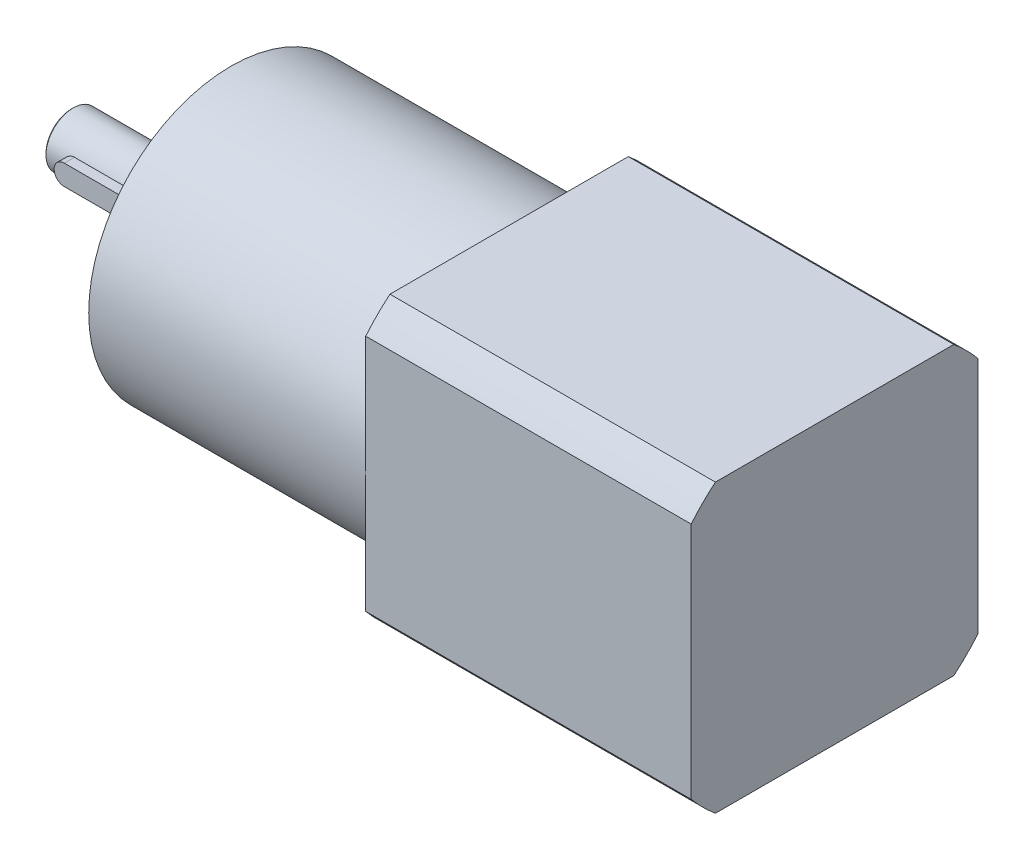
ISO-10303-21;
HEADER;
FILE_DESCRIPTION(('STEP AP214'),'2;1');
FILE_NAME('part.step','',(''),(''),'','','');
FILE_SCHEMA(('AUTOMOTIVE_DESIGN { 1 0 10303 214 1 1 1 1 }'));
ENDSEC;
DATA;
#1=APPLICATION_CONTEXT('core data for automotive mechanical design processes');
#2=APPLICATION_PROTOCOL_DEFINITION('international standard','automotive_design',2000,#1);
#3=PRODUCT_CONTEXT('',#1,'mechanical');
#4=PRODUCT('Part','Part','',(#3));
#5=PRODUCT_RELATED_PRODUCT_CATEGORY('part','',(#4));
#6=PRODUCT_DEFINITION_FORMATION('','',#4);
#7=PRODUCT_DEFINITION_CONTEXT('part definition',#1,'design');
#8=PRODUCT_DEFINITION('design','',#6,#7);
#9=PRODUCT_DEFINITION_SHAPE('','',#8);
#10=(LENGTH_UNIT() NAMED_UNIT(*) SI_UNIT(.MILLI.,.METRE.));
#11=(NAMED_UNIT(*) PLANE_ANGLE_UNIT() SI_UNIT($,.RADIAN.));
#12=(NAMED_UNIT(*) SI_UNIT($,.STERADIAN.) SOLID_ANGLE_UNIT());
#13=UNCERTAINTY_MEASURE_WITH_UNIT(LENGTH_MEASURE(1.E-05),#10,'distance_accuracy_value','');
#14=(GEOMETRIC_REPRESENTATION_CONTEXT(3) GLOBAL_UNCERTAINTY_ASSIGNED_CONTEXT((#13)) GLOBAL_UNIT_ASSIGNED_CONTEXT((#10,
#11,#12)) REPRESENTATION_CONTEXT('',''));
#15=CARTESIAN_POINT('',(0.,0.,0.));
#16=DIRECTION('',(0.,0.,1.));
#17=DIRECTION('',(1.,0.,0.));
#18=AXIS2_PLACEMENT_3D('',#15,#16,#17);
#19=CARTESIAN_POINT('',(-19.4,0.,5.19999999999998));
#20=DIRECTION('',(0.,0.,-1.));
#21=DIRECTION('',(-1.,0.,0.));
#22=AXIS2_PLACEMENT_3D('',#19,#20,#21);
#23=CYLINDRICAL_SURFACE('',#22,1.5);
#24=CARTESIAN_POINT('',(-19.4,0.,0.));
#25=DIRECTION('',(0.,0.,1.));
#26=DIRECTION('',(1.,0.,0.));
#27=AXIS2_PLACEMENT_3D('',#24,#25,#26);
#28=CIRCLE('',#27,1.5);
#29=CARTESIAN_POINT('',(-19.4,1.5,0.));
#30=VERTEX_POINT('',#29);
#31=CARTESIAN_POINT('',(-19.4,-1.5,0.));
#32=VERTEX_POINT('',#31);
#33=EDGE_CURVE('E111',#30,#32,#28,.T.);
#34=ORIENTED_EDGE('',*,*,#33,.T.);
#35=DIRECTION('',(0.,0.,-1.));
#36=VECTOR('',#35,1.);
#37=CARTESIAN_POINT('',(-19.4,-1.49999999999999,5.19999999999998));
#38=LINE('',#37,#36);
#39=CARTESIAN_POINT('',(-19.4,-1.49999999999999,5.19999999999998));
#40=VERTEX_POINT('',#39);
#41=EDGE_CURVE('E13',#40,#32,#38,.T.);
#42=ORIENTED_EDGE('',*,*,#41,.F.);
#43=CARTESIAN_POINT('',(-19.4,0.,5.19999999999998));
#44=DIRECTION('',(0.,0.,1.));
#45=DIRECTION('',(1.,0.,0.));
#46=AXIS2_PLACEMENT_3D('',#43,#44,#45);
#47=CIRCLE('',#46,1.5);
#48=CARTESIAN_POINT('',(-19.4,1.50000000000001,5.19999999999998));
#49=VERTEX_POINT('',#48);
#50=EDGE_CURVE('E99',#49,#40,#47,.T.);
#51=ORIENTED_EDGE('',*,*,#50,.F.);
#52=DIRECTION('',(0.,0.,-1.));
#53=VECTOR('',#52,1.);
#54=CARTESIAN_POINT('',(-19.4,1.50000000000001,5.19999999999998));
#55=LINE('',#54,#53);
#56=EDGE_CURVE('E107',#49,#30,#55,.T.);
#57=ORIENTED_EDGE('',*,*,#56,.T.);
#58=EDGE_LOOP('',(#34,#42,#51,#57));
#59=FACE_BOUND('',#58,.T.);
#60=ADVANCED_FACE('F48',(#59),#23,.T.);
#61=CARTESIAN_POINT('',(-19.4,-1.49999999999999,5.19999999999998));
#62=DIRECTION('',(0.,1.,0.));
#63=DIRECTION('',(0.,0.,1.));
#64=AXIS2_PLACEMENT_3D('',#61,#62,#63);
#65=PLANE('',#64);
#66=DIRECTION('',(1.,0.,0.));
#67=VECTOR('',#66,1.);
#68=CARTESIAN_POINT('',(-19.4,-1.5,0.));
#69=LINE('',#68,#67);
#70=CARTESIAN_POINT('',(-8.40000000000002,-1.5,0.));
#71=VERTEX_POINT('',#70);
#72=EDGE_CURVE('E103',#32,#71,#69,.T.);
#73=ORIENTED_EDGE('',*,*,#72,.T.);
#74=DIRECTION('',(0.,0.,-1.));
#75=VECTOR('',#74,1.);
#76=CARTESIAN_POINT('',(-8.40000000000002,-1.49999999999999,5.19999999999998));
#77=LINE('',#76,#75);
#78=CARTESIAN_POINT('',(-8.40000000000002,-1.49999999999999,5.19999999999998));
#79=VERTEX_POINT('',#78);
#80=EDGE_CURVE('E56',#79,#71,#77,.T.);
#81=ORIENTED_EDGE('',*,*,#80,.F.);
#82=DIRECTION('',(1.,0.,0.));
#83=VECTOR('',#82,1.);
#84=CARTESIAN_POINT('',(-19.4,-1.49999999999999,5.19999999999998));
#85=LINE('',#84,#83);
#86=EDGE_CURVE('E94',#40,#79,#85,.T.);
#87=ORIENTED_EDGE('',*,*,#86,.F.);
#88=ORIENTED_EDGE('',*,*,#41,.T.);
#89=EDGE_LOOP('',(#73,#81,#87,#88));
#90=FACE_BOUND('',#89,.T.);
#91=ADVANCED_FACE('F102',(#90),#65,.F.);
#92=CARTESIAN_POINT('',(-8.40000000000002,0.,5.19999999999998));
#93=DIRECTION('',(0.,0.,-1.));
#94=DIRECTION('',(-1.,0.,0.));
#95=AXIS2_PLACEMENT_3D('',#92,#93,#94);
#96=CYLINDRICAL_SURFACE('',#95,1.5);
#97=CARTESIAN_POINT('',(-8.40000000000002,0.,0.));
#98=DIRECTION('',(0.,0.,1.));
#99=DIRECTION('',(1.,0.,0.));
#100=AXIS2_PLACEMENT_3D('',#97,#98,#99);
#101=CIRCLE('',#100,1.5);
#102=CARTESIAN_POINT('',(-8.40000000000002,1.5,0.));
#103=VERTEX_POINT('',#102);
#104=EDGE_CURVE('E81',#71,#103,#101,.T.);
#105=ORIENTED_EDGE('',*,*,#104,.T.);
#106=DIRECTION('',(0.,0.,-1.));
#107=VECTOR('',#106,1.);
#108=CARTESIAN_POINT('',(-8.40000000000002,1.50000000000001,5.19999999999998));
#109=LINE('',#108,#107);
#110=CARTESIAN_POINT('',(-8.40000000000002,1.50000000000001,5.19999999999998));
#111=VERTEX_POINT('',#110);
#112=EDGE_CURVE('E104',#111,#103,#109,.T.);
#113=ORIENTED_EDGE('',*,*,#112,.F.);
#114=CARTESIAN_POINT('',(-8.40000000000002,0.,5.19999999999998));
#115=DIRECTION('',(0.,0.,1.));
#116=DIRECTION('',(1.,0.,0.));
#117=AXIS2_PLACEMENT_3D('',#114,#115,#116);
#118=CIRCLE('',#117,1.5);
#119=EDGE_CURVE('E97',#79,#111,#118,.T.);
#120=ORIENTED_EDGE('',*,*,#119,.F.);
#121=ORIENTED_EDGE('',*,*,#80,.T.);
#122=EDGE_LOOP('',(#105,#113,#120,#121));
#123=FACE_BOUND('',#122,.T.);
#124=ADVANCED_FACE('F105',(#123),#96,.T.);
#125=CARTESIAN_POINT('',(-19.4,1.50000000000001,5.19999999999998));
#126=DIRECTION('',(0.,-1.,0.));
#127=DIRECTION('',(0.,0.,-1.));
#128=AXIS2_PLACEMENT_3D('',#125,#126,#127);
#129=PLANE('',#128);
#130=DIRECTION('',(-1.,0.,0.));
#131=VECTOR('',#130,1.);
#132=CARTESIAN_POINT('',(-19.4,1.5,0.));
#133=LINE('',#132,#131);
#134=EDGE_CURVE('E87',#103,#30,#133,.T.);
#135=ORIENTED_EDGE('',*,*,#134,.T.);
#136=ORIENTED_EDGE('',*,*,#56,.F.);
#137=DIRECTION('',(-1.,0.,0.));
#138=VECTOR('',#137,1.);
#139=CARTESIAN_POINT('',(-19.4,1.50000000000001,5.19999999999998));
#140=LINE('',#139,#138);
#141=EDGE_CURVE('E64',#111,#49,#140,.T.);
#142=ORIENTED_EDGE('',*,*,#141,.F.);
#143=ORIENTED_EDGE('',*,*,#112,.T.);
#144=EDGE_LOOP('',(#135,#136,#142,#143));
#145=FACE_BOUND('',#144,.T.);
#146=ADVANCED_FACE('F118',(#145),#129,.F.);
#147=CARTESIAN_POINT('',(-19.4,0.,5.19999999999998));
#148=DIRECTION('',(0.,0.,1.));
#149=DIRECTION('',(1.,0.,0.));
#150=AXIS2_PLACEMENT_3D('',#147,#148,#149);
#151=PLANE('',#150);
#152=ORIENTED_EDGE('',*,*,#50,.T.);
#153=ORIENTED_EDGE('',*,*,#86,.T.);
#154=ORIENTED_EDGE('',*,*,#119,.T.);
#155=ORIENTED_EDGE('',*,*,#141,.T.);
#156=EDGE_LOOP('',(#152,#153,#154,#155));
#157=FACE_BOUND('',#156,.T.);
#158=ADVANCED_FACE('F95',(#157),#151,.T.);
#159=CARTESIAN_POINT('',(-19.4,0.,0.));
#160=DIRECTION('',(0.,0.,1.));
#161=DIRECTION('',(1.,0.,0.));
#162=AXIS2_PLACEMENT_3D('',#159,#160,#161);
#163=PLANE('',#162);
#164=ORIENTED_EDGE('',*,*,#33,.F.);
#165=ORIENTED_EDGE('',*,*,#134,.F.);
#166=ORIENTED_EDGE('',*,*,#104,.F.);
#167=ORIENTED_EDGE('',*,*,#72,.F.);
#168=EDGE_LOOP('',(#164,#165,#166,#167));
#169=FACE_BOUND('',#168,.T.);
#170=ADVANCED_FACE('F121',(#169),#163,.F.);
#171=CLOSED_SHELL('',(#60,#91,#124,#146,#158,#170));
#172=MANIFOLD_SOLID_BREP('B2',#171);
#173=CARTESIAN_POINT('',(-23.5,4.,0.));
#174=DIRECTION('',(1.,0.,0.));
#175=DIRECTION('',(0.,1.,0.));
#176=AXIS2_PLACEMENT_3D('',#173,#174,#175);
#177=PLANE('',#176);
#178=CARTESIAN_POINT('',(-23.5,0.,0.));
#179=DIRECTION('',(1.,0.,0.));
#180=DIRECTION('',(0.,1.,0.));
#181=AXIS2_PLACEMENT_3D('',#178,#179,#180);
#182=CIRCLE('',#181,3.80000000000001);
#183=CARTESIAN_POINT('',(-23.5,3.80000000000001,0.));
#184=VERTEX_POINT('',#183);
#185=EDGE_CURVE('E187',#184,#184,#182,.F.);
#186=ORIENTED_EDGE('',*,*,#185,.T.);
#187=EDGE_LOOP('',(#186));
#188=FACE_BOUND('',#187,.T.);
#189=ADVANCED_FACE('F180',(#188),#177,.F.);
#190=CARTESIAN_POINT('',(-2.,4.,0.));
#191=DIRECTION('',(-1.,0.,0.));
#192=DIRECTION('',(0.,-1.,0.));
#193=AXIS2_PLACEMENT_3D('',#190,#191,#192);
#194=PLANE('',#193);
#195=CARTESIAN_POINT('',(-2.,0.,0.));
#196=DIRECTION('',(-1.,0.,0.));
#197=DIRECTION('',(0.,-1.,0.));
#198=AXIS2_PLACEMENT_3D('',#195,#196,#197);
#199=CIRCLE('',#198,4.);
#200=CARTESIAN_POINT('',(-2.,-3.99999999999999,0.));
#201=VERTEX_POINT('',#200);
#202=EDGE_CURVE('E191',#201,#201,#199,.T.);
#203=ORIENTED_EDGE('',*,*,#202,.F.);
#204=EDGE_LOOP('',(#203));
#205=FACE_BOUND('',#204,.T.);
#206=ADVANCED_FACE('F200',(#205),#194,.F.);
#207=CARTESIAN_POINT('',(-41.2245185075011,0.,2.22044604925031E-13));
#208=DIRECTION('',(-1.,0.,0.));
#209=DIRECTION('',(0.,-1.,0.));
#210=AXIS2_PLACEMENT_3D('',#207,#208,#209);
#211=CYLINDRICAL_SURFACE('',#210,4.);
#212=CARTESIAN_POINT('',(-23.3,0.,0.));
#213=DIRECTION('',(1.,0.,0.));
#214=DIRECTION('',(0.,1.,0.));
#215=AXIS2_PLACEMENT_3D('',#212,#213,#214);
#216=CIRCLE('',#215,4.);
#217=CARTESIAN_POINT('',(-23.3,4.,0.));
#218=VERTEX_POINT('',#217);
#219=EDGE_CURVE('E47',#218,#218,#216,.T.);
#220=ORIENTED_EDGE('',*,*,#219,.T.);
#221=EDGE_LOOP('',(#220));
#222=FACE_BOUND('',#221,.T.);
#223=ORIENTED_EDGE('',*,*,#202,.T.);
#224=EDGE_LOOP('',(#223));
#225=FACE_BOUND('',#224,.T.);
#226=ADVANCED_FACE('F198',(#222,#225),#211,.T.);
#227=CARTESIAN_POINT('',(-23.5,0.,0.));
#228=DIRECTION('',(1.,0.,0.));
#229=DIRECTION('',(0.,1.,0.));
#230=AXIS2_PLACEMENT_3D('',#227,#228,#229);
#231=CONICAL_SURFACE('',#230,3.80000000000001,0.785398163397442);
#232=ORIENTED_EDGE('',*,*,#219,.F.);
#233=EDGE_LOOP('',(#232));
#234=FACE_BOUND('',#233,.T.);
#235=ORIENTED_EDGE('',*,*,#185,.F.);
#236=EDGE_LOOP('',(#235));
#237=FACE_BOUND('',#236,.T.);
#238=ADVANCED_FACE('F182',(#234,#237),#231,.T.);
#239=CLOSED_SHELL('',(#189,#206,#226,#238));
#240=MANIFOLD_SOLID_BREP('B7',#239);
#241=CARTESIAN_POINT('',(41.,21.,0.));
#242=DIRECTION('',(1.,0.,0.));
#243=DIRECTION('',(0.,0.,-1.));
#244=AXIS2_PLACEMENT_3D('',#241,#242,#243);
#245=PLANE('',#244);
#246=CARTESIAN_POINT('',(41.,0.,0.));
#247=DIRECTION('',(-1.,0.,0.));
#248=DIRECTION('',(0.,0.,1.));
#249=AXIS2_PLACEMENT_3D('',#246,#247,#248);
#250=CIRCLE('',#249,21.);
#251=CARTESIAN_POINT('',(41.,0.,21.));
#252=VERTEX_POINT('',#251);
#253=EDGE_CURVE('E341',#252,#252,#250,.T.);
#254=ORIENTED_EDGE('',*,*,#253,.F.);
#255=EDGE_LOOP('',(#254));
#256=FACE_BOUND('',#255,.T.);
#257=DIRECTION('',(0.,0.,1.));
#258=VECTOR('',#257,1.);
#259=CARTESIAN_POINT('',(40.9999999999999,-21.15,-21.15));
#260=LINE('',#259,#258);
#261=CARTESIAN_POINT('',(40.9999999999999,-21.15,-17.5763335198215));
#262=VERTEX_POINT('',#261);
#263=CARTESIAN_POINT('',(41.,-21.15,17.5763335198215));
#264=VERTEX_POINT('',#263);
#265=EDGE_CURVE('E318',#262,#264,#260,.T.);
#266=ORIENTED_EDGE('',*,*,#265,.T.);
#267=CARTESIAN_POINT('',(41.,0.,0.));
#268=DIRECTION('',(-1.,0.,0.));
#269=DIRECTION('',(0.,0.,1.));
#270=AXIS2_PLACEMENT_3D('',#267,#268,#269);
#271=CIRCLE('',#270,27.5);
#272=CARTESIAN_POINT('',(41.,-17.5763335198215,21.15));
#273=VERTEX_POINT('',#272);
#274=EDGE_CURVE('E325',#264,#273,#271,.T.);
#275=ORIENTED_EDGE('',*,*,#274,.T.);
#276=DIRECTION('',(0.,1.,0.));
#277=VECTOR('',#276,1.);
#278=CARTESIAN_POINT('',(41.,-21.15,21.15));
#279=LINE('',#278,#277);
#280=CARTESIAN_POINT('',(41.,17.5763335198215,21.15));
#281=VERTEX_POINT('',#280);
#282=EDGE_CURVE('E309',#273,#281,#279,.T.);
#283=ORIENTED_EDGE('',*,*,#282,.T.);
#284=CARTESIAN_POINT('',(41.,21.15,17.5763335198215));
#285=VERTEX_POINT('',#284);
#286=EDGE_CURVE('E335',#281,#285,#271,.T.);
#287=ORIENTED_EDGE('',*,*,#286,.T.);
#288=DIRECTION('',(0.,0.,-1.));
#289=VECTOR('',#288,1.);
#290=CARTESIAN_POINT('',(41.,21.15,21.15));
#291=LINE('',#290,#289);
#292=CARTESIAN_POINT('',(40.9999999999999,21.15,-17.5763335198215));
#293=VERTEX_POINT('',#292);
#294=EDGE_CURVE('E317',#285,#293,#291,.T.);
#295=ORIENTED_EDGE('',*,*,#294,.T.);
#296=CARTESIAN_POINT('',(40.9999999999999,17.5763335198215,-21.15));
#297=VERTEX_POINT('',#296);
#298=EDGE_CURVE('E336',#293,#297,#271,.T.);
#299=ORIENTED_EDGE('',*,*,#298,.T.);
#300=DIRECTION('',(0.,-1.,0.));
#301=VECTOR('',#300,1.);
#302=CARTESIAN_POINT('',(40.9999999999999,21.15,-21.15));
#303=LINE('',#302,#301);
#304=CARTESIAN_POINT('',(40.9999999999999,-17.5763335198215,-21.15));
#305=VERTEX_POINT('',#304);
#306=EDGE_CURVE('E328',#297,#305,#303,.T.);
#307=ORIENTED_EDGE('',*,*,#306,.T.);
#308=EDGE_CURVE('E332',#305,#262,#271,.T.);
#309=ORIENTED_EDGE('',*,*,#308,.T.);
#310=EDGE_LOOP('',(#266,#275,#283,#287,#295,#299,#307,#309));
#311=FACE_BOUND('',#310,.T.);
#312=ADVANCED_FACE('F235',(#256,#311),#245,.F.);
#313=CARTESIAN_POINT('',(-41.0735057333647,0.,2.22044604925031E-13));
#314=DIRECTION('',(-1.,0.,0.));
#315=DIRECTION('',(0.,0.,1.));
#316=AXIS2_PLACEMENT_3D('',#313,#314,#315);
#317=CYLINDRICAL_SURFACE('',#316,27.5);
#318=DIRECTION('',(-1.,0.,0.));
#319=VECTOR('',#318,1.);
#320=CARTESIAN_POINT('',(-41.0735057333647,-21.15,17.5763335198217));
#321=LINE('',#320,#319);
#322=CARTESIAN_POINT('',(88.9999999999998,-21.15,17.5763335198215));
#323=VERTEX_POINT('',#322);
#324=EDGE_CURVE('E367',#323,#264,#321,.T.);
#325=ORIENTED_EDGE('',*,*,#324,.F.);
#326=CARTESIAN_POINT('',(88.9999999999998,0.,0.));
#327=DIRECTION('',(-1.,0.,0.));
#328=DIRECTION('',(0.,0.,1.));
#329=AXIS2_PLACEMENT_3D('',#326,#327,#328);
#330=CIRCLE('',#329,27.5);
#331=CARTESIAN_POINT('',(88.9999999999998,-17.5763335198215,21.15));
#332=VERTEX_POINT('',#331);
#333=EDGE_CURVE('E327',#323,#332,#330,.T.);
#334=ORIENTED_EDGE('',*,*,#333,.T.);
#335=DIRECTION('',(-1.,0.,0.));
#336=VECTOR('',#335,1.);
#337=CARTESIAN_POINT('',(-41.0735057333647,-17.5763335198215,21.1500000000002));
#338=LINE('',#337,#336);
#339=EDGE_CURVE('E250',#273,#332,#338,.F.);
#340=ORIENTED_EDGE('',*,*,#339,.F.);
#341=ORIENTED_EDGE('',*,*,#274,.F.);
#342=EDGE_LOOP('',(#325,#334,#340,#341));
#343=FACE_BOUND('',#342,.T.);
#344=ADVANCED_FACE('F324',(#343),#317,.T.);
#345=DIRECTION('',(-1.,0.,0.));
#346=VECTOR('',#345,1.);
#347=CARTESIAN_POINT('',(-41.0735057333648,-21.15,-17.5763335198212));
#348=LINE('',#347,#346);
#349=CARTESIAN_POINT('',(88.9999999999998,-21.15,-17.5763335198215));
#350=VERTEX_POINT('',#349);
#351=EDGE_CURVE('E257',#262,#350,#348,.F.);
#352=ORIENTED_EDGE('',*,*,#351,.F.);
#353=ORIENTED_EDGE('',*,*,#308,.F.);
#354=DIRECTION('',(-1.,0.,0.));
#355=VECTOR('',#354,1.);
#356=CARTESIAN_POINT('',(-41.0735057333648,-17.5763335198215,-21.1499999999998));
#357=LINE('',#356,#355);
#358=CARTESIAN_POINT('',(88.9999999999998,-17.5763335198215,-21.15));
#359=VERTEX_POINT('',#358);
#360=EDGE_CURVE('E359',#359,#305,#357,.T.);
#361=ORIENTED_EDGE('',*,*,#360,.F.);
#362=EDGE_CURVE('E394',#359,#350,#330,.T.);
#363=ORIENTED_EDGE('',*,*,#362,.T.);
#364=EDGE_LOOP('',(#352,#353,#361,#363));
#365=FACE_BOUND('',#364,.T.);
#366=ADVANCED_FACE('F399',(#365),#317,.T.);
#367=DIRECTION('',(-1.,0.,0.));
#368=VECTOR('',#367,1.);
#369=CARTESIAN_POINT('',(-41.0735057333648,17.5763335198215,-21.1499999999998));
#370=LINE('',#369,#368);
#371=CARTESIAN_POINT('',(88.9999999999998,17.5763335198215,-21.15));
#372=VERTEX_POINT('',#371);
#373=EDGE_CURVE('E356',#297,#372,#370,.F.);
#374=ORIENTED_EDGE('',*,*,#373,.F.);
#375=ORIENTED_EDGE('',*,*,#298,.F.);
#376=DIRECTION('',(-1.,0.,0.));
#377=VECTOR('',#376,1.);
#378=CARTESIAN_POINT('',(-41.0735057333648,21.15,-17.5763335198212));
#379=LINE('',#378,#377);
#380=CARTESIAN_POINT('',(88.9999999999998,21.15,-17.5763335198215));
#381=VERTEX_POINT('',#380);
#382=EDGE_CURVE('E354',#381,#293,#379,.T.);
#383=ORIENTED_EDGE('',*,*,#382,.F.);
#384=EDGE_CURVE('E338',#381,#372,#330,.T.);
#385=ORIENTED_EDGE('',*,*,#384,.T.);
#386=EDGE_LOOP('',(#374,#375,#383,#385));
#387=FACE_BOUND('',#386,.T.);
#388=ADVANCED_FACE('F352',(#387),#317,.T.);
#389=DIRECTION('',(-1.,0.,0.));
#390=VECTOR('',#389,1.);
#391=CARTESIAN_POINT('',(-41.0735057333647,21.15,17.5763335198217));
#392=LINE('',#391,#390);
#393=CARTESIAN_POINT('',(88.9999999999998,21.15,17.5763335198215));
#394=VERTEX_POINT('',#393);
#395=EDGE_CURVE('E362',#285,#394,#392,.F.);
#396=ORIENTED_EDGE('',*,*,#395,.F.);
#397=ORIENTED_EDGE('',*,*,#286,.F.);
#398=DIRECTION('',(-1.,0.,0.));
#399=VECTOR('',#398,1.);
#400=CARTESIAN_POINT('',(-41.0735057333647,17.5763335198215,21.1500000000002));
#401=LINE('',#400,#399);
#402=CARTESIAN_POINT('',(88.9999999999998,17.5763335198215,21.15));
#403=VERTEX_POINT('',#402);
#404=EDGE_CURVE('E312',#403,#281,#401,.T.);
#405=ORIENTED_EDGE('',*,*,#404,.F.);
#406=EDGE_CURVE('E333',#403,#394,#330,.T.);
#407=ORIENTED_EDGE('',*,*,#406,.T.);
#408=EDGE_LOOP('',(#396,#397,#405,#407));
#409=FACE_BOUND('',#408,.T.);
#410=ADVANCED_FACE('F416',(#409),#317,.T.);
#411=CARTESIAN_POINT('',(88.9999999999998,27.5,0.));
#412=DIRECTION('',(-1.,0.,0.));
#413=DIRECTION('',(0.,0.,1.));
#414=AXIS2_PLACEMENT_3D('',#411,#412,#413);
#415=PLANE('',#414);
#416=DIRECTION('',(0.,0.,1.));
#417=VECTOR('',#416,1.);
#418=CARTESIAN_POINT('',(88.9999999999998,-21.15,0.));
#419=LINE('',#418,#417);
#420=EDGE_CURVE('E178',#350,#323,#419,.T.);
#421=ORIENTED_EDGE('',*,*,#420,.F.);
#422=ORIENTED_EDGE('',*,*,#362,.F.);
#423=DIRECTION('',(0.,-1.,0.));
#424=VECTOR('',#423,1.);
#425=CARTESIAN_POINT('',(88.9999999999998,27.5,-21.15));
#426=LINE('',#425,#424);
#427=EDGE_CURVE('E243',#372,#359,#426,.T.);
#428=ORIENTED_EDGE('',*,*,#427,.F.);
#429=ORIENTED_EDGE('',*,*,#384,.F.);
#430=DIRECTION('',(0.,0.,-1.));
#431=VECTOR('',#430,1.);
#432=CARTESIAN_POINT('',(88.9999999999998,21.15,0.));
#433=LINE('',#432,#431);
#434=EDGE_CURVE('E411',#394,#381,#433,.T.);
#435=ORIENTED_EDGE('',*,*,#434,.F.);
#436=ORIENTED_EDGE('',*,*,#406,.F.);
#437=DIRECTION('',(0.,1.,0.));
#438=VECTOR('',#437,1.);
#439=CARTESIAN_POINT('',(88.9999999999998,27.5,21.15));
#440=LINE('',#439,#438);
#441=EDGE_CURVE('E414',#332,#403,#440,.T.);
#442=ORIENTED_EDGE('',*,*,#441,.F.);
#443=ORIENTED_EDGE('',*,*,#333,.F.);
#444=EDGE_LOOP('',(#421,#422,#428,#429,#435,#436,#442,#443));
#445=FACE_BOUND('',#444,.T.);
#446=ADVANCED_FACE('F401',(#445),#415,.F.);
#447=CARTESIAN_POINT('',(-2.,0.,0.));
#448=DIRECTION('',(1.,0.,0.));
#449=DIRECTION('',(0.,0.,-1.));
#450=AXIS2_PLACEMENT_3D('',#447,#448,#449);
#451=PLANE('',#450);
#452=CARTESIAN_POINT('',(-2.,0.,0.));
#453=DIRECTION('',(-1.,0.,0.));
#454=DIRECTION('',(0.,0.,1.));
#455=AXIS2_PLACEMENT_3D('',#452,#453,#454);
#456=CIRCLE('',#455,12.5);
#457=CARTESIAN_POINT('',(-2.,0.,12.5));
#458=VERTEX_POINT('',#457);
#459=EDGE_CURVE('E450',#458,#458,#456,.T.);
#460=ORIENTED_EDGE('',*,*,#459,.T.);
#461=EDGE_LOOP('',(#460));
#462=FACE_BOUND('',#461,.T.);
#463=ADVANCED_FACE('F237',(#462),#451,.F.);
#464=CARTESIAN_POINT('',(-41.0735057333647,0.,2.22044604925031E-13));
#465=DIRECTION('',(-1.,0.,0.));
#466=DIRECTION('',(0.,0.,1.));
#467=AXIS2_PLACEMENT_3D('',#464,#465,#466);
#468=CYLINDRICAL_SURFACE('',#467,12.5);
#469=ORIENTED_EDGE('',*,*,#459,.F.);
#470=EDGE_LOOP('',(#469));
#471=FACE_BOUND('',#470,.T.);
#472=CARTESIAN_POINT('',(0.,0.,0.));
#473=DIRECTION('',(-1.,0.,0.));
#474=DIRECTION('',(0.,0.,1.));
#475=AXIS2_PLACEMENT_3D('',#472,#473,#474);
#476=CIRCLE('',#475,12.5);
#477=CARTESIAN_POINT('',(0.,0.,12.5));
#478=VERTEX_POINT('',#477);
#479=EDGE_CURVE('E453',#478,#478,#476,.T.);
#480=ORIENTED_EDGE('',*,*,#479,.T.);
#481=EDGE_LOOP('',(#480));
#482=FACE_BOUND('',#481,.T.);
#483=ADVANCED_FACE('F439',(#471,#482),#468,.T.);
#484=CARTESIAN_POINT('',(0.,12.5,0.));
#485=DIRECTION('',(1.,0.,0.));
#486=DIRECTION('',(0.,0.,-1.));
#487=AXIS2_PLACEMENT_3D('',#484,#485,#486);
#488=PLANE('',#487);
#489=CARTESIAN_POINT('',(0.,17.5,0.));
#490=DIRECTION('',(-1.,0.,0.));
#491=DIRECTION('',(0.,0.,1.));
#492=AXIS2_PLACEMENT_3D('',#489,#490,#491);
#493=CIRCLE('',#492,1.65);
#494=CARTESIAN_POINT('',(0.,17.5,1.65));
#495=VERTEX_POINT('',#494);
#496=EDGE_CURVE('E369',#495,#495,#493,.T.);
#497=ORIENTED_EDGE('',*,*,#496,.F.);
#498=EDGE_LOOP('',(#497));
#499=FACE_BOUND('',#498,.T.);
#500=CARTESIAN_POINT('',(0.,0.,17.5));
#501=DIRECTION('',(-1.,0.,0.));
#502=DIRECTION('',(0.,0.,1.));
#503=AXIS2_PLACEMENT_3D('',#500,#501,#502);
#504=CIRCLE('',#503,1.65);
#505=CARTESIAN_POINT('',(0.,0.,19.15));
#506=VERTEX_POINT('',#505);
#507=EDGE_CURVE('E375',#506,#506,#504,.T.);
#508=ORIENTED_EDGE('',*,*,#507,.F.);
#509=EDGE_LOOP('',(#508));
#510=FACE_BOUND('',#509,.T.);
#511=CARTESIAN_POINT('',(0.,-17.5,0.));
#512=DIRECTION('',(-1.,0.,0.));
#513=DIRECTION('',(0.,0.,1.));
#514=AXIS2_PLACEMENT_3D('',#511,#512,#513);
#515=CIRCLE('',#514,1.65);
#516=CARTESIAN_POINT('',(0.,-17.5,1.65));
#517=VERTEX_POINT('',#516);
#518=EDGE_CURVE('E381',#517,#517,#515,.T.);
#519=ORIENTED_EDGE('',*,*,#518,.F.);
#520=EDGE_LOOP('',(#519));
#521=FACE_BOUND('',#520,.T.);
#522=CARTESIAN_POINT('',(-1.11022302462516E-13,0.,-17.5));
#523=DIRECTION('',(-1.,0.,0.));
#524=DIRECTION('',(0.,0.,1.));
#525=AXIS2_PLACEMENT_3D('',#522,#523,#524);
#526=CIRCLE('',#525,1.65);
#527=CARTESIAN_POINT('',(-1.11022302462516E-13,0.,-15.85));
#528=VERTEX_POINT('',#527);
#529=EDGE_CURVE('E387',#528,#528,#526,.T.);
#530=ORIENTED_EDGE('',*,*,#529,.F.);
#531=EDGE_LOOP('',(#530));
#532=FACE_BOUND('',#531,.T.);
#533=ORIENTED_EDGE('',*,*,#479,.F.);
#534=EDGE_LOOP('',(#533));
#535=FACE_BOUND('',#534,.T.);
#536=CARTESIAN_POINT('',(0.,0.,0.));
#537=DIRECTION('',(-1.,0.,0.));
#538=DIRECTION('',(0.,0.,1.));
#539=AXIS2_PLACEMENT_3D('',#536,#537,#538);
#540=CIRCLE('',#539,21.);
#541=CARTESIAN_POINT('',(0.,0.,21.));
#542=VERTEX_POINT('',#541);
#543=EDGE_CURVE('E344',#542,#542,#540,.T.);
#544=ORIENTED_EDGE('',*,*,#543,.T.);
#545=EDGE_LOOP('',(#544));
#546=FACE_BOUND('',#545,.T.);
#547=ADVANCED_FACE('F436',(#499,#510,#521,#532,#535,#546),#488,.F.);
#548=CARTESIAN_POINT('',(-41.0735057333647,0.,2.22044604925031E-13));
#549=DIRECTION('',(-1.,0.,0.));
#550=DIRECTION('',(0.,0.,1.));
#551=AXIS2_PLACEMENT_3D('',#548,#549,#550);
#552=CYLINDRICAL_SURFACE('',#551,21.);
#553=ORIENTED_EDGE('',*,*,#543,.F.);
#554=EDGE_LOOP('',(#553));
#555=FACE_BOUND('',#554,.T.);
#556=ORIENTED_EDGE('',*,*,#253,.T.);
#557=EDGE_LOOP('',(#556));
#558=FACE_BOUND('',#557,.T.);
#559=ADVANCED_FACE('F432',(#555,#558),#552,.T.);
#560=CARTESIAN_POINT('',(10.0999999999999,0.,-17.5));
#561=DIRECTION('',(-1.,0.,0.));
#562=DIRECTION('',(0.,0.,1.));
#563=AXIS2_PLACEMENT_3D('',#560,#561,#562);
#564=CONICAL_SURFACE('',#563,1.65,1.02974425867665);
#565=CARTESIAN_POINT('',(11.0914200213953,0.,-17.5));
#566=VERTEX_POINT('',#565);
#567=VERTEX_LOOP('',#566);
#568=FACE_BOUND('',#567,.T.);
#569=CARTESIAN_POINT('',(10.0999999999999,0.,-17.5));
#570=DIRECTION('',(-1.,0.,0.));
#571=DIRECTION('',(0.,0.,1.));
#572=AXIS2_PLACEMENT_3D('',#569,#570,#571);
#573=CIRCLE('',#572,1.65);
#574=CARTESIAN_POINT('',(10.0999999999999,0.,-15.85));
#575=VERTEX_POINT('',#574);
#576=EDGE_CURVE('E390',#575,#575,#573,.T.);
#577=ORIENTED_EDGE('',*,*,#576,.T.);
#578=EDGE_LOOP('',(#577));
#579=FACE_BOUND('',#578,.T.);
#580=ADVANCED_FACE('F435',(#568,#579),#564,.F.);
#581=CARTESIAN_POINT('',(-1.11022302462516E-13,0.,-17.5));
#582=DIRECTION('',(-1.,0.,0.));
#583=DIRECTION('',(0.,0.,1.));
#584=AXIS2_PLACEMENT_3D('',#581,#582,#583);
#585=CYLINDRICAL_SURFACE('',#584,1.65);
#586=ORIENTED_EDGE('',*,*,#576,.F.);
#587=EDGE_LOOP('',(#586));
#588=FACE_BOUND('',#587,.T.);
#589=ORIENTED_EDGE('',*,*,#529,.T.);
#590=EDGE_LOOP('',(#589));
#591=FACE_BOUND('',#590,.T.);
#592=ADVANCED_FACE('F495',(#588,#591),#585,.F.);
#593=CARTESIAN_POINT('',(10.1,-17.5,0.));
#594=DIRECTION('',(-1.,0.,0.));
#595=DIRECTION('',(0.,0.,1.));
#596=AXIS2_PLACEMENT_3D('',#593,#594,#595);
#597=CONICAL_SURFACE('',#596,1.65,1.02974425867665);
#598=CARTESIAN_POINT('',(11.0914200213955,-17.5,0.));
#599=VERTEX_POINT('',#598);
#600=VERTEX_LOOP('',#599);
#601=FACE_BOUND('',#600,.T.);
#602=CARTESIAN_POINT('',(10.1,-17.5,0.));
#603=DIRECTION('',(-1.,0.,0.));
#604=DIRECTION('',(0.,0.,1.));
#605=AXIS2_PLACEMENT_3D('',#602,#603,#604);
#606=CIRCLE('',#605,1.65);
#607=CARTESIAN_POINT('',(10.1,-17.5,1.65));
#608=VERTEX_POINT('',#607);
#609=EDGE_CURVE('E384',#608,#608,#606,.T.);
#610=ORIENTED_EDGE('',*,*,#609,.T.);
#611=EDGE_LOOP('',(#610));
#612=FACE_BOUND('',#611,.T.);
#613=ADVANCED_FACE('F491',(#601,#612),#597,.F.);
#614=CARTESIAN_POINT('',(0.,-17.5,0.));
#615=DIRECTION('',(-1.,0.,0.));
#616=DIRECTION('',(0.,0.,1.));
#617=AXIS2_PLACEMENT_3D('',#614,#615,#616);
#618=CYLINDRICAL_SURFACE('',#617,1.65);
#619=ORIENTED_EDGE('',*,*,#609,.F.);
#620=EDGE_LOOP('',(#619));
#621=FACE_BOUND('',#620,.T.);
#622=ORIENTED_EDGE('',*,*,#518,.T.);
#623=EDGE_LOOP('',(#622));
#624=FACE_BOUND('',#623,.T.);
#625=ADVANCED_FACE('F487',(#621,#624),#618,.F.);
#626=CARTESIAN_POINT('',(10.1,0.,17.5));
#627=DIRECTION('',(-1.,0.,0.));
#628=DIRECTION('',(0.,0.,1.));
#629=AXIS2_PLACEMENT_3D('',#626,#627,#628);
#630=CONICAL_SURFACE('',#629,1.65,1.02974425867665);
#631=CARTESIAN_POINT('',(11.0914200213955,0.,17.5));
#632=VERTEX_POINT('',#631);
#633=VERTEX_LOOP('',#632);
#634=FACE_BOUND('',#633,.T.);
#635=CARTESIAN_POINT('',(10.1,0.,17.5));
#636=DIRECTION('',(-1.,0.,0.));
#637=DIRECTION('',(0.,0.,1.));
#638=AXIS2_PLACEMENT_3D('',#635,#636,#637);
#639=CIRCLE('',#638,1.65);
#640=CARTESIAN_POINT('',(10.1,0.,19.15));
#641=VERTEX_POINT('',#640);
#642=EDGE_CURVE('E378',#641,#641,#639,.T.);
#643=ORIENTED_EDGE('',*,*,#642,.T.);
#644=EDGE_LOOP('',(#643));
#645=FACE_BOUND('',#644,.T.);
#646=ADVANCED_FACE('F483',(#634,#645),#630,.F.);
#647=CARTESIAN_POINT('',(0.,0.,17.5));
#648=DIRECTION('',(-1.,0.,0.));
#649=DIRECTION('',(0.,0.,1.));
#650=AXIS2_PLACEMENT_3D('',#647,#648,#649);
#651=CYLINDRICAL_SURFACE('',#650,1.65);
#652=ORIENTED_EDGE('',*,*,#642,.F.);
#653=EDGE_LOOP('',(#652));
#654=FACE_BOUND('',#653,.T.);
#655=ORIENTED_EDGE('',*,*,#507,.T.);
#656=EDGE_LOOP('',(#655));
#657=FACE_BOUND('',#656,.T.);
#658=ADVANCED_FACE('F479',(#654,#657),#651,.F.);
#659=CARTESIAN_POINT('',(10.1,17.5,0.));
#660=DIRECTION('',(-1.,0.,0.));
#661=DIRECTION('',(0.,0.,1.));
#662=AXIS2_PLACEMENT_3D('',#659,#660,#661);
#663=CONICAL_SURFACE('',#662,1.65,1.02974425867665);
#664=CARTESIAN_POINT('',(11.0914200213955,17.5,0.));
#665=VERTEX_POINT('',#664);
#666=VERTEX_LOOP('',#665);
#667=FACE_BOUND('',#666,.T.);
#668=CARTESIAN_POINT('',(10.1,17.5,0.));
#669=DIRECTION('',(-1.,0.,0.));
#670=DIRECTION('',(0.,0.,1.));
#671=AXIS2_PLACEMENT_3D('',#668,#669,#670);
#672=CIRCLE('',#671,1.65);
#673=CARTESIAN_POINT('',(10.1,17.5,1.65));
#674=VERTEX_POINT('',#673);
#675=EDGE_CURVE('E372',#674,#674,#672,.T.);
#676=ORIENTED_EDGE('',*,*,#675,.T.);
#677=EDGE_LOOP('',(#676));
#678=FACE_BOUND('',#677,.T.);
#679=ADVANCED_FACE('F475',(#667,#678),#663,.F.);
#680=CARTESIAN_POINT('',(0.,17.5,0.));
#681=DIRECTION('',(-1.,0.,0.));
#682=DIRECTION('',(0.,0.,1.));
#683=AXIS2_PLACEMENT_3D('',#680,#681,#682);
#684=CYLINDRICAL_SURFACE('',#683,1.65);
#685=ORIENTED_EDGE('',*,*,#675,.F.);
#686=EDGE_LOOP('',(#685));
#687=FACE_BOUND('',#686,.T.);
#688=ORIENTED_EDGE('',*,*,#496,.T.);
#689=EDGE_LOOP('',(#688));
#690=FACE_BOUND('',#689,.T.);
#691=ADVANCED_FACE('F471',(#687,#690),#684,.F.);
#692=CARTESIAN_POINT('',(88.9999999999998,-21.15,21.15));
#693=DIRECTION('',(0.,0.,1.));
#694=DIRECTION('',(0.,-1.,0.));
#695=AXIS2_PLACEMENT_3D('',#692,#693,#694);
#696=PLANE('',#695);
#697=ORIENTED_EDGE('',*,*,#404,.T.);
#698=ORIENTED_EDGE('',*,*,#282,.F.);
#699=ORIENTED_EDGE('',*,*,#339,.T.);
#700=ORIENTED_EDGE('',*,*,#441,.T.);
#701=EDGE_LOOP('',(#697,#698,#699,#700));
#702=FACE_BOUND('',#701,.T.);
#703=ADVANCED_FACE('F310',(#702),#696,.T.);
#704=CARTESIAN_POINT('',(88.9999999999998,21.15,21.15));
#705=DIRECTION('',(0.,1.,0.));
#706=DIRECTION('',(0.,0.,1.));
#707=AXIS2_PLACEMENT_3D('',#704,#705,#706);
#708=PLANE('',#707);
#709=ORIENTED_EDGE('',*,*,#382,.T.);
#710=ORIENTED_EDGE('',*,*,#294,.F.);
#711=ORIENTED_EDGE('',*,*,#395,.T.);
#712=ORIENTED_EDGE('',*,*,#434,.T.);
#713=EDGE_LOOP('',(#709,#710,#711,#712));
#714=FACE_BOUND('',#713,.T.);
#715=ADVANCED_FACE('F410',(#714),#708,.T.);
#716=CARTESIAN_POINT('',(88.9999999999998,21.15,-21.15));
#717=DIRECTION('',(0.,0.,-1.));
#718=DIRECTION('',(0.,1.,0.));
#719=AXIS2_PLACEMENT_3D('',#716,#717,#718);
#720=PLANE('',#719);
#721=ORIENTED_EDGE('',*,*,#360,.T.);
#722=ORIENTED_EDGE('',*,*,#306,.F.);
#723=ORIENTED_EDGE('',*,*,#373,.T.);
#724=ORIENTED_EDGE('',*,*,#427,.T.);
#725=EDGE_LOOP('',(#721,#722,#723,#724));
#726=FACE_BOUND('',#725,.T.);
#727=ADVANCED_FACE('F460',(#726),#720,.T.);
#728=CARTESIAN_POINT('',(88.9999999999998,-21.15,-21.15));
#729=DIRECTION('',(0.,-1.,0.));
#730=DIRECTION('',(0.,0.,-1.));
#731=AXIS2_PLACEMENT_3D('',#728,#729,#730);
#732=PLANE('',#731);
#733=ORIENTED_EDGE('',*,*,#324,.T.);
#734=ORIENTED_EDGE('',*,*,#265,.F.);
#735=ORIENTED_EDGE('',*,*,#351,.T.);
#736=ORIENTED_EDGE('',*,*,#420,.T.);
#737=EDGE_LOOP('',(#733,#734,#735,#736));
#738=FACE_BOUND('',#737,.T.);
#739=ADVANCED_FACE('F402',(#738),#732,.T.);
#740=CLOSED_SHELL('',(#312,#344,#366,#388,#410,#446,#463,#483,#547,#559,#580,#592,#613,#625,
#646,#658,#679,#691,#703,#715,#727,#739));
#741=MANIFOLD_SOLID_BREP('B42',#740);
#742=ADVANCED_BREP_SHAPE_REPRESENTATION('',(#18,#172,#240,#741),#14);
#743=SHAPE_DEFINITION_REPRESENTATION(#9,#742);
ENDSEC;
END-ISO-10303-21;
